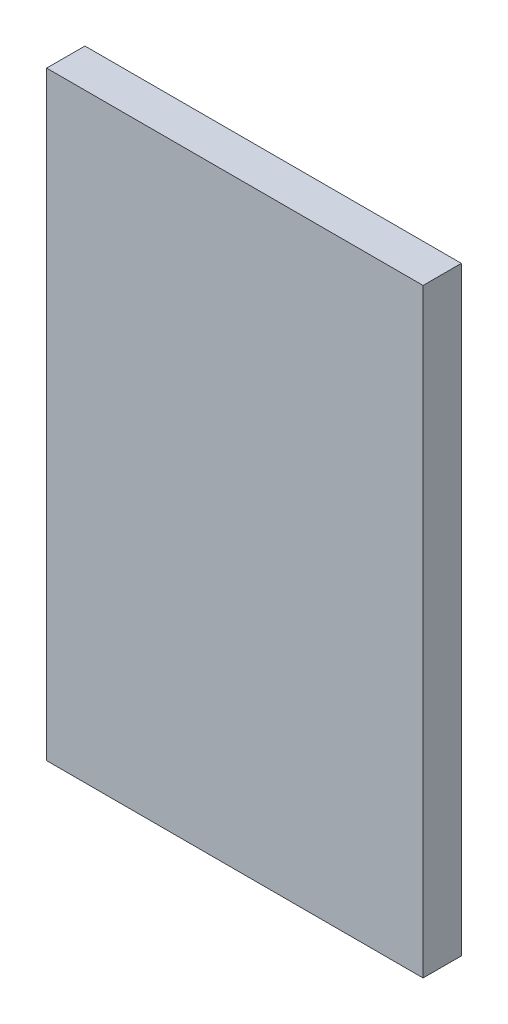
from build123d import *

# Parameters (mm, degrees)
ESQUISSE1_W        = 29.5
ESQUISSE1_H        = 47
BOSS_EXTRU_1_DEPTH = 3


with BuildPart() as part:
    # Esquisse1 → Boss.-Extru.1 (new body)
    with BuildSketch(Plane.XY):
        Rectangle(ESQUISSE1_W, ESQUISSE1_H)
    extrude(amount=BOSS_EXTRU_1_DEPTH)


solid = part.part
